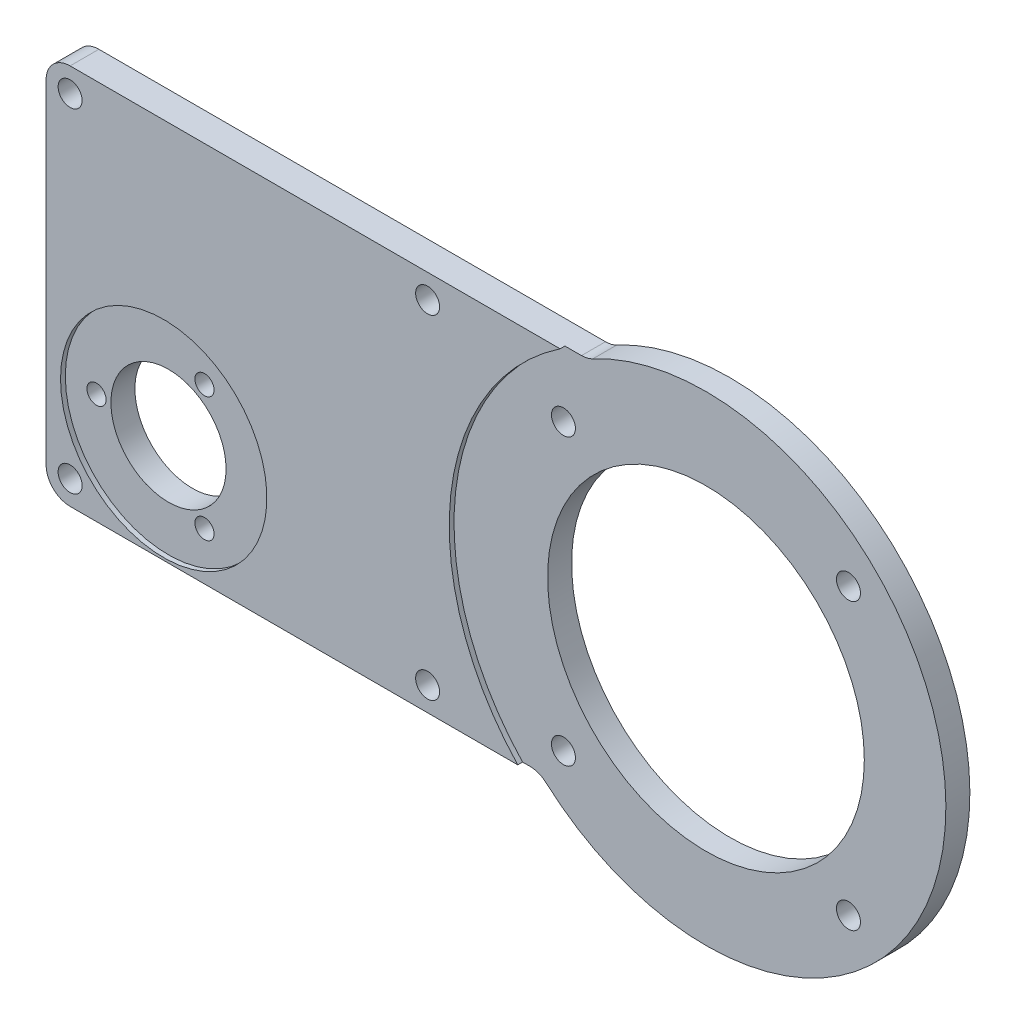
ISO-10303-21;
HEADER;
FILE_DESCRIPTION(('STEP AP214'),'2;1');
FILE_NAME('part.step','',(''),(''),'','','');
FILE_SCHEMA(('AUTOMOTIVE_DESIGN { 1 0 10303 214 1 1 1 1 }'));
ENDSEC;
DATA;
#1=APPLICATION_CONTEXT('core data for automotive mechanical design processes');
#2=APPLICATION_PROTOCOL_DEFINITION('international standard','automotive_design',2000,#1);
#3=PRODUCT_CONTEXT('',#1,'mechanical');
#4=PRODUCT('Part','Part','',(#3));
#5=PRODUCT_RELATED_PRODUCT_CATEGORY('part','',(#4));
#6=PRODUCT_DEFINITION_FORMATION('','',#4);
#7=PRODUCT_DEFINITION_CONTEXT('part definition',#1,'design');
#8=PRODUCT_DEFINITION('design','',#6,#7);
#9=PRODUCT_DEFINITION_SHAPE('','',#8);
#10=(LENGTH_UNIT() NAMED_UNIT(*) SI_UNIT(.MILLI.,.METRE.));
#11=(NAMED_UNIT(*) PLANE_ANGLE_UNIT() SI_UNIT($,.RADIAN.));
#12=(NAMED_UNIT(*) SI_UNIT($,.STERADIAN.) SOLID_ANGLE_UNIT());
#13=UNCERTAINTY_MEASURE_WITH_UNIT(LENGTH_MEASURE(1.E-05),#10,'distance_accuracy_value','');
#14=(GEOMETRIC_REPRESENTATION_CONTEXT(3) GLOBAL_UNCERTAINTY_ASSIGNED_CONTEXT((#13)) GLOBAL_UNIT_ASSIGNED_CONTEXT((#10,
#11,#12)) REPRESENTATION_CONTEXT('',''));
#15=CARTESIAN_POINT('',(0.,0.,0.));
#16=DIRECTION('',(0.,0.,1.));
#17=DIRECTION('',(1.,0.,0.));
#18=AXIS2_PLACEMENT_3D('',#15,#16,#17);
#19=CARTESIAN_POINT('',(-224.,-28.,10.));
#20=DIRECTION('',(0.,0.,-1.));
#21=DIRECTION('',(-1.,0.,0.));
#22=AXIS2_PLACEMENT_3D('',#19,#20,#21);
#23=PLANE('',#22);
#24=CARTESIAN_POINT('',(-209.,-53.9807621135,10.));
#25=DIRECTION('',(0.,0.,1.));
#26=DIRECTION('',(1.,0.,0.));
#27=AXIS2_PLACEMENT_3D('',#24,#25,#26);
#28=CIRCLE('',#27,4.);
#29=CARTESIAN_POINT('',(-205.,-53.9807621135,10.));
#30=VERTEX_POINT('',#29);
#31=EDGE_CURVE('E331',#30,#30,#28,.T.);
#32=ORIENTED_EDGE('',*,*,#31,.F.);
#33=EDGE_LOOP('',(#32));
#34=FACE_BOUND('',#33,.T.);
#35=CARTESIAN_POINT('',(-209.,-2.01923788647,10.));
#36=DIRECTION('',(0.,0.,1.));
#37=DIRECTION('',(1.,0.,0.));
#38=AXIS2_PLACEMENT_3D('',#35,#36,#37);
#39=CIRCLE('',#38,4.);
#40=CARTESIAN_POINT('',(-205.,-2.01923788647,10.));
#41=VERTEX_POINT('',#40);
#42=EDGE_CURVE('E319',#41,#41,#39,.T.);
#43=ORIENTED_EDGE('',*,*,#42,.F.);
#44=EDGE_LOOP('',(#43));
#45=FACE_BOUND('',#44,.T.);
#46=CARTESIAN_POINT('',(-224.,-28.,10.));
#47=DIRECTION('',(0.,0.,1.));
#48=DIRECTION('',(-1.,0.,0.));
#49=AXIS2_PLACEMENT_3D('',#46,#47,#48);
#50=CIRCLE('',#49,43.);
#51=CARTESIAN_POINT('',(-267.,-28.,10.));
#52=VERTEX_POINT('',#51);
#53=EDGE_CURVE('E115',#52,#52,#50,.T.);
#54=ORIENTED_EDGE('',*,*,#53,.T.);
#55=EDGE_LOOP('',(#54));
#56=FACE_BOUND('',#55,.T.);
#57=CARTESIAN_POINT('',(-254.,-28.,10.));
#58=DIRECTION('',(0.,0.,1.));
#59=DIRECTION('',(1.,0.,0.));
#60=AXIS2_PLACEMENT_3D('',#57,#58,#59);
#61=CIRCLE('',#60,4.);
#62=CARTESIAN_POINT('',(-250.,-28.,10.));
#63=VERTEX_POINT('',#62);
#64=EDGE_CURVE('E325',#63,#63,#61,.T.);
#65=ORIENTED_EDGE('',*,*,#64,.F.);
#66=EDGE_LOOP('',(#65));
#67=FACE_BOUND('',#66,.T.);
#68=CARTESIAN_POINT('',(-224.,-28.,10.));
#69=DIRECTION('',(0.,0.,1.));
#70=DIRECTION('',(1.,0.,0.));
#71=AXIS2_PLACEMENT_3D('',#68,#69,#70);
#72=CIRCLE('',#71,24.);
#73=CARTESIAN_POINT('',(-200.,-28.,10.));
#74=VERTEX_POINT('',#73);
#75=EDGE_CURVE('E337',#74,#74,#72,.T.);
#76=ORIENTED_EDGE('',*,*,#75,.F.);
#77=EDGE_LOOP('',(#76));
#78=FACE_BOUND('',#77,.T.);
#79=ADVANCED_FACE('F31',(#34,#45,#56,#67,#78),#23,.F.);
#80=CARTESIAN_POINT('',(-51.8748493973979,96.999999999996,12.));
#81=DIRECTION('',(0.,0.,-1.));
#82=DIRECTION('',(-1.,0.,0.));
#83=AXIS2_PLACEMENT_3D('',#80,#81,#82);
#84=CYLINDRICAL_SURFACE('',#83,10.0000000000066);
#85=DIRECTION('',(0.,0.,-1.));
#86=VECTOR('',#85,1.);
#87=CARTESIAN_POINT('',(-51.8748493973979,86.9999999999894,12.));
#88=LINE('',#87,#86);
#89=CARTESIAN_POINT('',(-51.8748493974,86.9999999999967,10.));
#90=VERTEX_POINT('',#89);
#91=CARTESIAN_POINT('',(-51.8748493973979,86.9999999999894,0.));
#92=VERTEX_POINT('',#91);
#93=EDGE_CURVE('E11',#90,#92,#88,.T.);
#94=ORIENTED_EDGE('',*,*,#93,.F.);
#95=CARTESIAN_POINT('',(-51.8748493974,97.,10.));
#96=DIRECTION('',(0.,0.,-1.));
#97=DIRECTION('',(-1.,0.,0.));
#98=AXIS2_PLACEMENT_3D('',#95,#96,#97);
#99=CIRCLE('',#98,10.0000000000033);
#100=CARTESIAN_POINT('',(-47.1589539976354,88.1818181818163,10.));
#101=VERTEX_POINT('',#100);
#102=EDGE_CURVE('E166',#101,#90,#99,.T.);
#103=ORIENTED_EDGE('',*,*,#102,.F.);
#104=DIRECTION('',(0.,0.,-1.));
#105=VECTOR('',#104,1.);
#106=CARTESIAN_POINT('',(-47.1589539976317,88.1818181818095,12.));
#107=LINE('',#106,#105);
#108=CARTESIAN_POINT('',(-47.1589539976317,88.1818181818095,0.));
#109=VERTEX_POINT('',#108);
#110=EDGE_CURVE('E35',#101,#109,#107,.T.);
#111=ORIENTED_EDGE('',*,*,#110,.T.);
#112=CARTESIAN_POINT('',(-51.8748493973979,96.999999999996,0.));
#113=DIRECTION('',(0.,0.,1.));
#114=DIRECTION('',(1.,0.,0.));
#115=AXIS2_PLACEMENT_3D('',#112,#113,#114);
#116=CIRCLE('',#115,10.0000000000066);
#117=EDGE_CURVE('E124',#92,#109,#116,.T.);
#118=ORIENTED_EDGE('',*,*,#117,.F.);
#119=EDGE_LOOP('',(#94,#103,#111,#118));
#120=FACE_BOUND('',#119,.T.);
#121=ADVANCED_FACE('F33',(#120),#84,.F.);
#122=CARTESIAN_POINT('',(-73.3212111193,-82.,12.));
#123=DIRECTION('',(0.,0.,-1.));
#124=DIRECTION('',(-1.,0.,0.));
#125=AXIS2_PLACEMENT_3D('',#122,#123,#124);
#126=CYLINDRICAL_SURFACE('',#125,10.000000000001);
#127=DIRECTION('',(0.,0.,-1.));
#128=VECTOR('',#127,1.);
#129=CARTESIAN_POINT('',(-66.6556464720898,-74.5454545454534,12.));
#130=LINE('',#129,#128);
#131=CARTESIAN_POINT('',(-66.655646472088,-74.5454545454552,10.));
#132=VERTEX_POINT('',#131);
#133=CARTESIAN_POINT('',(-66.6556464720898,-74.5454545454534,0.));
#134=VERTEX_POINT('',#133);
#135=EDGE_CURVE('E154',#132,#134,#130,.T.);
#136=ORIENTED_EDGE('',*,*,#135,.F.);
#137=CARTESIAN_POINT('',(-73.3212111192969,-82.0000000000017,10.));
#138=DIRECTION('',(0.,0.,-1.));
#139=DIRECTION('',(-1.,0.,0.));
#140=AXIS2_PLACEMENT_3D('',#137,#138,#139);
#141=CIRCLE('',#140,10.0000000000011);
#142=CARTESIAN_POINT('',(-73.3212111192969,-72.0000000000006,10.));
#143=VERTEX_POINT('',#142);
#144=EDGE_CURVE('E203',#143,#132,#141,.T.);
#145=ORIENTED_EDGE('',*,*,#144,.F.);
#146=DIRECTION('',(0.,0.,-1.));
#147=VECTOR('',#146,1.);
#148=CARTESIAN_POINT('',(-73.3212111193,-71.999999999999,12.));
#149=LINE('',#148,#147);
#150=CARTESIAN_POINT('',(-73.3212111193,-71.999999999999,0.));
#151=VERTEX_POINT('',#150);
#152=EDGE_CURVE('E153',#143,#151,#149,.T.);
#153=ORIENTED_EDGE('',*,*,#152,.T.);
#154=CARTESIAN_POINT('',(-73.3212111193,-82.,0.));
#155=DIRECTION('',(0.,0.,1.));
#156=DIRECTION('',(1.,0.,0.));
#157=AXIS2_PLACEMENT_3D('',#154,#155,#156);
#158=CIRCLE('',#157,10.000000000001);
#159=EDGE_CURVE('E172',#134,#151,#158,.T.);
#160=ORIENTED_EDGE('',*,*,#159,.F.);
#161=EDGE_LOOP('',(#136,#145,#153,#160));
#162=FACE_BOUND('',#161,.T.);
#163=ADVANCED_FACE('F207',(#162),#126,.F.);
#164=CARTESIAN_POINT('',(0.,0.,12.));
#165=DIRECTION('',(0.,0.,-1.));
#166=DIRECTION('',(-1.,0.,0.));
#167=AXIS2_PLACEMENT_3D('',#164,#165,#166);
#168=CYLINDRICAL_SURFACE('',#167,100.000000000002);
#169=ORIENTED_EDGE('',*,*,#110,.F.);
#170=CARTESIAN_POINT('',(-2.63331023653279E-12,4.92314522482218E-12,10.));
#171=DIRECTION('',(0.,0.,1.));
#172=DIRECTION('',(1.,0.,0.));
#173=AXIS2_PLACEMENT_3D('',#170,#171,#172);
#174=CIRCLE('',#173,100.000000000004);
#175=EDGE_CURVE('E114',#132,#101,#174,.T.);
#176=ORIENTED_EDGE('',*,*,#175,.F.);
#177=ORIENTED_EDGE('',*,*,#135,.T.);
#178=CARTESIAN_POINT('',(0.,0.,0.));
#179=DIRECTION('',(0.,0.,-1.));
#180=DIRECTION('',(-1.,0.,0.));
#181=AXIS2_PLACEMENT_3D('',#178,#179,#180);
#182=CIRCLE('',#181,100.000000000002);
#183=EDGE_CURVE('E168',#109,#134,#182,.T.);
#184=ORIENTED_EDGE('',*,*,#183,.F.);
#185=EDGE_LOOP('',(#169,#176,#177,#184));
#186=FACE_BOUND('',#185,.T.);
#187=ADVANCED_FACE('F169',(#186),#168,.T.);
#188=CARTESIAN_POINT('',(-262.999999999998,86.9999999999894,12.));
#189=DIRECTION('',(0.,1.,0.));
#190=DIRECTION('',(0.,0.,1.));
#191=AXIS2_PLACEMENT_3D('',#188,#189,#190);
#192=PLANE('',#191);
#193=DIRECTION('',(0.,0.,1.));
#194=VECTOR('',#193,1.);
#195=CARTESIAN_POINT('',(-58.7877538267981,86.9999999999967,10.));
#196=LINE('',#195,#194);
#197=CARTESIAN_POINT('',(-58.7877538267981,86.9999999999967,10.));
#198=VERTEX_POINT('',#197);
#199=CARTESIAN_POINT('',(-58.7877538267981,86.9999999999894,12.));
#200=VERTEX_POINT('',#199);
#201=EDGE_CURVE('E48',#198,#200,#196,.T.);
#202=ORIENTED_EDGE('',*,*,#201,.F.);
#203=DIRECTION('',(-1.,0.,0.));
#204=VECTOR('',#203,1.);
#205=CARTESIAN_POINT('',(-51.8748493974,86.9999999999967,10.));
#206=LINE('',#205,#204);
#207=EDGE_CURVE('E194',#90,#198,#206,.T.);
#208=ORIENTED_EDGE('',*,*,#207,.F.);
#209=ORIENTED_EDGE('',*,*,#93,.T.);
#210=DIRECTION('',(1.,0.,0.));
#211=VECTOR('',#210,1.);
#212=CARTESIAN_POINT('',(-262.999999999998,86.9999999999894,0.));
#213=LINE('',#212,#211);
#214=CARTESIAN_POINT('',(-262.999999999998,86.9999999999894,0.));
#215=VERTEX_POINT('',#214);
#216=EDGE_CURVE('E131',#215,#92,#213,.T.);
#217=ORIENTED_EDGE('',*,*,#216,.F.);
#218=DIRECTION('',(0.,0.,-1.));
#219=VECTOR('',#218,1.);
#220=CARTESIAN_POINT('',(-262.999999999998,86.9999999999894,12.));
#221=LINE('',#220,#219);
#222=CARTESIAN_POINT('',(-262.999999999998,86.9999999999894,12.));
#223=VERTEX_POINT('',#222);
#224=EDGE_CURVE('E40',#223,#215,#221,.T.);
#225=ORIENTED_EDGE('',*,*,#224,.F.);
#226=DIRECTION('',(1.,0.,0.));
#227=VECTOR('',#226,1.);
#228=CARTESIAN_POINT('',(-262.999999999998,86.9999999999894,12.));
#229=LINE('',#228,#227);
#230=EDGE_CURVE('E144',#223,#200,#229,.T.);
#231=ORIENTED_EDGE('',*,*,#230,.T.);
#232=EDGE_LOOP('',(#202,#208,#209,#217,#225,#231));
#233=FACE_BOUND('',#232,.T.);
#234=ADVANCED_FACE('F191',(#233),#192,.T.);
#235=CARTESIAN_POINT('',(-263.,76.9999999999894,12.));
#236=DIRECTION('',(0.,0.,-1.));
#237=DIRECTION('',(-1.,0.,0.));
#238=AXIS2_PLACEMENT_3D('',#235,#236,#237);
#239=CYLINDRICAL_SURFACE('',#238,10.);
#240=CARTESIAN_POINT('',(-263.,76.9999999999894,0.));
#241=DIRECTION('',(0.,0.,-1.));
#242=DIRECTION('',(-1.,0.,0.));
#243=AXIS2_PLACEMENT_3D('',#240,#241,#242);
#244=CIRCLE('',#243,10.);
#245=CARTESIAN_POINT('',(-273.,76.9999999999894,0.));
#246=VERTEX_POINT('',#245);
#247=EDGE_CURVE('E136',#246,#215,#244,.T.);
#248=ORIENTED_EDGE('',*,*,#247,.F.);
#249=DIRECTION('',(0.,0.,-1.));
#250=VECTOR('',#249,1.);
#251=CARTESIAN_POINT('',(-273.,76.9999999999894,12.));
#252=LINE('',#251,#250);
#253=CARTESIAN_POINT('',(-273.,76.9999999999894,12.));
#254=VERTEX_POINT('',#253);
#255=EDGE_CURVE('E147',#254,#246,#252,.T.);
#256=ORIENTED_EDGE('',*,*,#255,.F.);
#257=CARTESIAN_POINT('',(-263.,76.9999999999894,12.));
#258=DIRECTION('',(0.,0.,-1.));
#259=DIRECTION('',(-1.,0.,0.));
#260=AXIS2_PLACEMENT_3D('',#257,#258,#259);
#261=CIRCLE('',#260,10.);
#262=EDGE_CURVE('E142',#254,#223,#261,.T.);
#263=ORIENTED_EDGE('',*,*,#262,.T.);
#264=ORIENTED_EDGE('',*,*,#224,.T.);
#265=EDGE_LOOP('',(#248,#256,#263,#264));
#266=FACE_BOUND('',#265,.T.);
#267=ADVANCED_FACE('F215',(#266),#239,.T.);
#268=CARTESIAN_POINT('',(-273.,-62.,12.));
#269=DIRECTION('',(-1.,0.,0.));
#270=DIRECTION('',(0.,0.,1.));
#271=AXIS2_PLACEMENT_3D('',#268,#269,#270);
#272=PLANE('',#271);
#273=DIRECTION('',(0.,1.,0.));
#274=VECTOR('',#273,1.);
#275=CARTESIAN_POINT('',(-273.,-62.,0.));
#276=LINE('',#275,#274);
#277=CARTESIAN_POINT('',(-273.,-62.,0.));
#278=VERTEX_POINT('',#277);
#279=EDGE_CURVE('E186',#278,#246,#276,.T.);
#280=ORIENTED_EDGE('',*,*,#279,.F.);
#281=DIRECTION('',(0.,0.,-1.));
#282=VECTOR('',#281,1.);
#283=CARTESIAN_POINT('',(-273.,-62.,12.));
#284=LINE('',#283,#282);
#285=CARTESIAN_POINT('',(-273.,-62.,12.));
#286=VERTEX_POINT('',#285);
#287=EDGE_CURVE('E149',#286,#278,#284,.T.);
#288=ORIENTED_EDGE('',*,*,#287,.F.);
#289=DIRECTION('',(0.,1.,0.));
#290=VECTOR('',#289,1.);
#291=CARTESIAN_POINT('',(-273.,-62.,12.));
#292=LINE('',#291,#290);
#293=EDGE_CURVE('E133',#286,#254,#292,.T.);
#294=ORIENTED_EDGE('',*,*,#293,.T.);
#295=ORIENTED_EDGE('',*,*,#255,.T.);
#296=EDGE_LOOP('',(#280,#288,#294,#295));
#297=FACE_BOUND('',#296,.T.);
#298=ADVANCED_FACE('F213',(#297),#272,.T.);
#299=CARTESIAN_POINT('',(-263.,-62.,12.));
#300=DIRECTION('',(0.,0.,-1.));
#301=DIRECTION('',(-1.,0.,0.));
#302=AXIS2_PLACEMENT_3D('',#299,#300,#301);
#303=CYLINDRICAL_SURFACE('',#302,10.);
#304=CARTESIAN_POINT('',(-263.,-62.,0.));
#305=DIRECTION('',(0.,0.,-1.));
#306=DIRECTION('',(-1.,0.,0.));
#307=AXIS2_PLACEMENT_3D('',#304,#305,#306);
#308=CIRCLE('',#307,10.);
#309=CARTESIAN_POINT('',(-263.,-72.,0.));
#310=VERTEX_POINT('',#309);
#311=EDGE_CURVE('E183',#310,#278,#308,.T.);
#312=ORIENTED_EDGE('',*,*,#311,.F.);
#313=DIRECTION('',(0.,0.,-1.));
#314=VECTOR('',#313,1.);
#315=CARTESIAN_POINT('',(-263.,-72.,12.));
#316=LINE('',#315,#314);
#317=CARTESIAN_POINT('',(-263.,-72.,12.));
#318=VERTEX_POINT('',#317);
#319=EDGE_CURVE('E151',#318,#310,#316,.T.);
#320=ORIENTED_EDGE('',*,*,#319,.F.);
#321=CARTESIAN_POINT('',(-263.,-62.,12.));
#322=DIRECTION('',(0.,0.,-1.));
#323=DIRECTION('',(-1.,0.,0.));
#324=AXIS2_PLACEMENT_3D('',#321,#322,#323);
#325=CIRCLE('',#324,10.);
#326=EDGE_CURVE('E130',#318,#286,#325,.T.);
#327=ORIENTED_EDGE('',*,*,#326,.T.);
#328=ORIENTED_EDGE('',*,*,#287,.T.);
#329=EDGE_LOOP('',(#312,#320,#327,#328));
#330=FACE_BOUND('',#329,.T.);
#331=ADVANCED_FACE('F211',(#330),#303,.T.);
#332=CARTESIAN_POINT('',(-73.3212111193,-72.,12.));
#333=DIRECTION('',(0.,-1.,0.));
#334=DIRECTION('',(0.,0.,-1.));
#335=AXIS2_PLACEMENT_3D('',#332,#333,#334);
#336=PLANE('',#335);
#337=DIRECTION('',(0.,0.,1.));
#338=VECTOR('',#337,1.);
#339=CARTESIAN_POINT('',(-76.4264352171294,-72.0000000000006,10.));
#340=LINE('',#339,#338);
#341=CARTESIAN_POINT('',(-76.4264352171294,-72.0000000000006,10.));
#342=VERTEX_POINT('',#341);
#343=CARTESIAN_POINT('',(-76.4264352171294,-72.0000000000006,12.));
#344=VERTEX_POINT('',#343);
#345=EDGE_CURVE('E109',#342,#344,#340,.T.);
#346=ORIENTED_EDGE('',*,*,#345,.T.);
#347=DIRECTION('',(-1.,0.,0.));
#348=VECTOR('',#347,1.);
#349=CARTESIAN_POINT('',(-73.3212111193,-72.,12.));
#350=LINE('',#349,#348);
#351=EDGE_CURVE('E120',#344,#318,#350,.T.);
#352=ORIENTED_EDGE('',*,*,#351,.T.);
#353=ORIENTED_EDGE('',*,*,#319,.T.);
#354=DIRECTION('',(-1.,0.,0.));
#355=VECTOR('',#354,1.);
#356=CARTESIAN_POINT('',(-73.3212111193,-72.,0.));
#357=LINE('',#356,#355);
#358=EDGE_CURVE('E180',#151,#310,#357,.T.);
#359=ORIENTED_EDGE('',*,*,#358,.F.);
#360=ORIENTED_EDGE('',*,*,#152,.F.);
#361=DIRECTION('',(1.,0.,0.));
#362=VECTOR('',#361,1.);
#363=CARTESIAN_POINT('',(-76.4264352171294,-72.0000000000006,10.));
#364=LINE('',#363,#362);
#365=EDGE_CURVE('E123',#342,#143,#364,.T.);
#366=ORIENTED_EDGE('',*,*,#365,.F.);
#367=EDGE_LOOP('',(#346,#352,#353,#359,#360,#366));
#368=FACE_BOUND('',#367,.T.);
#369=ADVANCED_FACE('F119',(#368),#336,.T.);
#370=CARTESIAN_POINT('',(-51.8748493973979,96.999999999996,12.));
#371=DIRECTION('',(0.,0.,1.));
#372=DIRECTION('',(1.,0.,0.));
#373=AXIS2_PLACEMENT_3D('',#370,#371,#372);
#374=PLANE('',#373);
#375=CARTESIAN_POINT('',(-263.,77.,12.));
#376=DIRECTION('',(0.,0.,1.));
#377=DIRECTION('',(1.,0.,0.));
#378=AXIS2_PLACEMENT_3D('',#375,#376,#377);
#379=CIRCLE('',#378,5.);
#380=CARTESIAN_POINT('',(-258.,77.,12.));
#381=VERTEX_POINT('',#380);
#382=EDGE_CURVE('E257',#381,#381,#379,.T.);
#383=ORIENTED_EDGE('',*,*,#382,.F.);
#384=EDGE_LOOP('',(#383));
#385=FACE_BOUND('',#384,.T.);
#386=CARTESIAN_POINT('',(-263.,-62.,12.));
#387=DIRECTION('',(0.,0.,1.));
#388=DIRECTION('',(1.,0.,0.));
#389=AXIS2_PLACEMENT_3D('',#386,#387,#388);
#390=CIRCLE('',#389,5.);
#391=CARTESIAN_POINT('',(-258.,-62.,12.));
#392=VERTEX_POINT('',#391);
#393=EDGE_CURVE('E261',#392,#392,#390,.T.);
#394=ORIENTED_EDGE('',*,*,#393,.F.);
#395=EDGE_LOOP('',(#394));
#396=FACE_BOUND('',#395,.T.);
#397=CARTESIAN_POINT('',(-114.,-62.,12.));
#398=DIRECTION('',(0.,0.,1.));
#399=DIRECTION('',(1.,0.,0.));
#400=AXIS2_PLACEMENT_3D('',#397,#398,#399);
#401=CIRCLE('',#400,4.99999999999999);
#402=CARTESIAN_POINT('',(-109.,-62.,12.));
#403=VERTEX_POINT('',#402);
#404=EDGE_CURVE('E265',#403,#403,#401,.T.);
#405=ORIENTED_EDGE('',*,*,#404,.F.);
#406=EDGE_LOOP('',(#405));
#407=FACE_BOUND('',#406,.T.);
#408=CARTESIAN_POINT('',(-114.,77.,12.));
#409=DIRECTION('',(0.,0.,1.));
#410=DIRECTION('',(1.,0.,0.));
#411=AXIS2_PLACEMENT_3D('',#408,#409,#410);
#412=CIRCLE('',#411,4.99999999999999);
#413=CARTESIAN_POINT('',(-109.,77.,12.));
#414=VERTEX_POINT('',#413);
#415=EDGE_CURVE('E269',#414,#414,#412,.T.);
#416=ORIENTED_EDGE('',*,*,#415,.F.);
#417=EDGE_LOOP('',(#416));
#418=FACE_BOUND('',#417,.T.);
#419=CARTESIAN_POINT('',(-224.,-28.,12.));
#420=DIRECTION('',(0.,0.,1.));
#421=DIRECTION('',(-1.,0.,0.));
#422=AXIS2_PLACEMENT_3D('',#419,#420,#421);
#423=CIRCLE('',#422,43.);
#424=CARTESIAN_POINT('',(-267.,-28.,12.));
#425=VERTEX_POINT('',#424);
#426=EDGE_CURVE('E272',#425,#425,#423,.T.);
#427=ORIENTED_EDGE('',*,*,#426,.F.);
#428=EDGE_LOOP('',(#427));
#429=FACE_BOUND('',#428,.T.);
#430=CARTESIAN_POINT('',(-2.63331023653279E-12,4.92314522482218E-12,12.));
#431=DIRECTION('',(0.,0.,1.));
#432=DIRECTION('',(1.,0.,0.));
#433=AXIS2_PLACEMENT_3D('',#430,#431,#432);
#434=CIRCLE('',#433,104.999999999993);
#435=EDGE_CURVE('E106',#200,#344,#434,.T.);
#436=ORIENTED_EDGE('',*,*,#435,.F.);
#437=ORIENTED_EDGE('',*,*,#230,.F.);
#438=ORIENTED_EDGE('',*,*,#262,.F.);
#439=ORIENTED_EDGE('',*,*,#293,.F.);
#440=ORIENTED_EDGE('',*,*,#326,.F.);
#441=ORIENTED_EDGE('',*,*,#351,.F.);
#442=EDGE_LOOP('',(#436,#437,#438,#439,#440,#441));
#443=FACE_BOUND('',#442,.T.);
#444=ADVANCED_FACE('F127',(#385,#396,#407,#418,#429,#443),#374,.T.);
#445=CARTESIAN_POINT('',(-51.8748493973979,96.999999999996,0.));
#446=DIRECTION('',(0.,0.,1.));
#447=DIRECTION('',(1.,0.,0.));
#448=AXIS2_PLACEMENT_3D('',#445,#446,#447);
#449=PLANE('',#448);
#450=CARTESIAN_POINT('',(-263.,77.,0.));
#451=DIRECTION('',(0.,0.,1.));
#452=DIRECTION('',(1.,0.,0.));
#453=AXIS2_PLACEMENT_3D('',#450,#451,#452);
#454=CIRCLE('',#453,5.);
#455=CARTESIAN_POINT('',(-258.,77.,0.));
#456=VERTEX_POINT('',#455);
#457=EDGE_CURVE('E344',#456,#456,#454,.T.);
#458=ORIENTED_EDGE('',*,*,#457,.T.);
#459=EDGE_LOOP('',(#458));
#460=FACE_BOUND('',#459,.T.);
#461=CARTESIAN_POINT('',(-263.,-62.,0.));
#462=DIRECTION('',(0.,0.,1.));
#463=DIRECTION('',(1.,0.,0.));
#464=AXIS2_PLACEMENT_3D('',#461,#462,#463);
#465=CIRCLE('',#464,5.);
#466=CARTESIAN_POINT('',(-258.,-62.,0.));
#467=VERTEX_POINT('',#466);
#468=EDGE_CURVE('E340',#467,#467,#465,.T.);
#469=ORIENTED_EDGE('',*,*,#468,.T.);
#470=EDGE_LOOP('',(#469));
#471=FACE_BOUND('',#470,.T.);
#472=CARTESIAN_POINT('',(-224.,-28.,0.));
#473=DIRECTION('',(0.,0.,1.));
#474=DIRECTION('',(1.,0.,0.));
#475=AXIS2_PLACEMENT_3D('',#472,#473,#474);
#476=CIRCLE('',#475,24.);
#477=CARTESIAN_POINT('',(-200.,-28.,0.));
#478=VERTEX_POINT('',#477);
#479=EDGE_CURVE('E334',#478,#478,#476,.T.);
#480=ORIENTED_EDGE('',*,*,#479,.T.);
#481=EDGE_LOOP('',(#480));
#482=FACE_BOUND('',#481,.T.);
#483=CARTESIAN_POINT('',(-209.,-53.9807621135,0.));
#484=DIRECTION('',(0.,0.,1.));
#485=DIRECTION('',(1.,0.,0.));
#486=AXIS2_PLACEMENT_3D('',#483,#484,#485);
#487=CIRCLE('',#486,4.);
#488=CARTESIAN_POINT('',(-205.,-53.9807621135,0.));
#489=VERTEX_POINT('',#488);
#490=EDGE_CURVE('E328',#489,#489,#487,.T.);
#491=ORIENTED_EDGE('',*,*,#490,.T.);
#492=EDGE_LOOP('',(#491));
#493=FACE_BOUND('',#492,.T.);
#494=CARTESIAN_POINT('',(-254.,-28.,0.));
#495=DIRECTION('',(0.,0.,1.));
#496=DIRECTION('',(1.,0.,0.));
#497=AXIS2_PLACEMENT_3D('',#494,#495,#496);
#498=CIRCLE('',#497,4.);
#499=CARTESIAN_POINT('',(-250.,-28.,0.));
#500=VERTEX_POINT('',#499);
#501=EDGE_CURVE('E322',#500,#500,#498,.T.);
#502=ORIENTED_EDGE('',*,*,#501,.T.);
#503=EDGE_LOOP('',(#502));
#504=FACE_BOUND('',#503,.T.);
#505=CARTESIAN_POINT('',(-209.,-2.01923788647,0.));
#506=DIRECTION('',(0.,0.,1.));
#507=DIRECTION('',(1.,0.,0.));
#508=AXIS2_PLACEMENT_3D('',#505,#506,#507);
#509=CIRCLE('',#508,4.);
#510=CARTESIAN_POINT('',(-205.,-2.01923788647,0.));
#511=VERTEX_POINT('',#510);
#512=EDGE_CURVE('E316',#511,#511,#509,.T.);
#513=ORIENTED_EDGE('',*,*,#512,.T.);
#514=EDGE_LOOP('',(#513));
#515=FACE_BOUND('',#514,.T.);
#516=CARTESIAN_POINT('',(-114.,-62.,0.));
#517=DIRECTION('',(0.,0.,1.));
#518=DIRECTION('',(1.,0.,0.));
#519=AXIS2_PLACEMENT_3D('',#516,#517,#518);
#520=CIRCLE('',#519,5.);
#521=CARTESIAN_POINT('',(-109.,-62.,0.));
#522=VERTEX_POINT('',#521);
#523=EDGE_CURVE('E312',#522,#522,#520,.T.);
#524=ORIENTED_EDGE('',*,*,#523,.T.);
#525=EDGE_LOOP('',(#524));
#526=FACE_BOUND('',#525,.T.);
#527=CARTESIAN_POINT('',(-59.3969696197,-59.3969696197,0.));
#528=DIRECTION('',(0.,0.,1.));
#529=DIRECTION('',(1.,0.,0.));
#530=AXIS2_PLACEMENT_3D('',#527,#528,#529);
#531=CIRCLE('',#530,4.99999999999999);
#532=CARTESIAN_POINT('',(-54.3969696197,-59.3969696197,0.));
#533=VERTEX_POINT('',#532);
#534=EDGE_CURVE('E306',#533,#533,#531,.T.);
#535=ORIENTED_EDGE('',*,*,#534,.T.);
#536=EDGE_LOOP('',(#535));
#537=FACE_BOUND('',#536,.T.);
#538=CARTESIAN_POINT('',(0.,0.,0.));
#539=DIRECTION('',(0.,0.,1.));
#540=DIRECTION('',(1.,0.,0.));
#541=AXIS2_PLACEMENT_3D('',#538,#539,#540);
#542=CIRCLE('',#541,66.);
#543=CARTESIAN_POINT('',(66.,0.,0.));
#544=VERTEX_POINT('',#543);
#545=EDGE_CURVE('E300',#544,#544,#542,.T.);
#546=ORIENTED_EDGE('',*,*,#545,.T.);
#547=EDGE_LOOP('',(#546));
#548=FACE_BOUND('',#547,.T.);
#549=CARTESIAN_POINT('',(-59.3969696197,59.3969696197,0.));
#550=DIRECTION('',(0.,0.,1.));
#551=DIRECTION('',(1.,0.,0.));
#552=AXIS2_PLACEMENT_3D('',#549,#550,#551);
#553=CIRCLE('',#552,4.99999999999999);
#554=CARTESIAN_POINT('',(-54.3969696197,59.3969696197,0.));
#555=VERTEX_POINT('',#554);
#556=EDGE_CURVE('E294',#555,#555,#553,.T.);
#557=ORIENTED_EDGE('',*,*,#556,.T.);
#558=EDGE_LOOP('',(#557));
#559=FACE_BOUND('',#558,.T.);
#560=CARTESIAN_POINT('',(-114.,77.,0.));
#561=DIRECTION('',(0.,0.,1.));
#562=DIRECTION('',(1.,0.,0.));
#563=AXIS2_PLACEMENT_3D('',#560,#561,#562);
#564=CIRCLE('',#563,5.);
#565=CARTESIAN_POINT('',(-109.,77.,0.));
#566=VERTEX_POINT('',#565);
#567=EDGE_CURVE('E290',#566,#566,#564,.T.);
#568=ORIENTED_EDGE('',*,*,#567,.T.);
#569=EDGE_LOOP('',(#568));
#570=FACE_BOUND('',#569,.T.);
#571=CARTESIAN_POINT('',(59.3969696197,59.3969696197,0.));
#572=DIRECTION('',(0.,0.,1.));
#573=DIRECTION('',(1.,0.,0.));
#574=AXIS2_PLACEMENT_3D('',#571,#572,#573);
#575=CIRCLE('',#574,4.99999999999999);
#576=CARTESIAN_POINT('',(64.3969696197,59.3969696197,0.));
#577=VERTEX_POINT('',#576);
#578=EDGE_CURVE('E284',#577,#577,#575,.T.);
#579=ORIENTED_EDGE('',*,*,#578,.T.);
#580=EDGE_LOOP('',(#579));
#581=FACE_BOUND('',#580,.T.);
#582=CARTESIAN_POINT('',(59.3969696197,-59.3969696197,0.));
#583=DIRECTION('',(0.,0.,1.));
#584=DIRECTION('',(1.,0.,0.));
#585=AXIS2_PLACEMENT_3D('',#582,#583,#584);
#586=CIRCLE('',#585,4.99999999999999);
#587=CARTESIAN_POINT('',(64.3969696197,-59.3969696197,0.));
#588=VERTEX_POINT('',#587);
#589=EDGE_CURVE('E274',#588,#588,#586,.T.);
#590=ORIENTED_EDGE('',*,*,#589,.T.);
#591=EDGE_LOOP('',(#590));
#592=FACE_BOUND('',#591,.T.);
#593=ORIENTED_EDGE('',*,*,#117,.T.);
#594=ORIENTED_EDGE('',*,*,#183,.T.);
#595=ORIENTED_EDGE('',*,*,#159,.T.);
#596=ORIENTED_EDGE('',*,*,#358,.T.);
#597=ORIENTED_EDGE('',*,*,#311,.T.);
#598=ORIENTED_EDGE('',*,*,#279,.T.);
#599=ORIENTED_EDGE('',*,*,#247,.T.);
#600=ORIENTED_EDGE('',*,*,#216,.T.);
#601=EDGE_LOOP('',(#593,#594,#595,#596,#597,#598,#599,#600));
#602=FACE_BOUND('',#601,.T.);
#603=ADVANCED_FACE('F174',(#460,#471,#482,#493,#504,#515,#526,#537,#548,#559,#570,#581,#592,
#602),#449,.F.);
#604=CARTESIAN_POINT('',(-2.63331023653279E-12,4.92314522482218E-12,10.));
#605=DIRECTION('',(0.,0.,1.));
#606=DIRECTION('',(1.,0.,0.));
#607=AXIS2_PLACEMENT_3D('',#604,#605,#606);
#608=CYLINDRICAL_SURFACE('',#607,104.999999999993);
#609=ORIENTED_EDGE('',*,*,#435,.T.);
#610=ORIENTED_EDGE('',*,*,#345,.F.);
#611=CARTESIAN_POINT('',(-2.63331023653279E-12,4.92314522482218E-12,10.));
#612=DIRECTION('',(0.,0.,1.));
#613=DIRECTION('',(1.,0.,0.));
#614=AXIS2_PLACEMENT_3D('',#611,#612,#613);
#615=CIRCLE('',#614,104.999999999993);
#616=EDGE_CURVE('E196',#198,#342,#615,.T.);
#617=ORIENTED_EDGE('',*,*,#616,.F.);
#618=ORIENTED_EDGE('',*,*,#201,.T.);
#619=EDGE_LOOP('',(#609,#610,#617,#618));
#620=FACE_BOUND('',#619,.T.);
#621=ADVANCED_FACE('F108',(#620),#608,.F.);
#622=CARTESIAN_POINT('',(-2.63331023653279E-12,4.92314522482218E-12,10.));
#623=DIRECTION('',(0.,0.,1.));
#624=DIRECTION('',(1.,0.,0.));
#625=AXIS2_PLACEMENT_3D('',#622,#623,#624);
#626=PLANE('',#625);
#627=CARTESIAN_POINT('',(-59.3969696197,-59.3969696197,10.));
#628=DIRECTION('',(0.,0.,1.));
#629=DIRECTION('',(1.,0.,0.));
#630=AXIS2_PLACEMENT_3D('',#627,#628,#629);
#631=CIRCLE('',#630,4.99999999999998);
#632=CARTESIAN_POINT('',(-54.3969696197,-59.3969696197,10.));
#633=VERTEX_POINT('',#632);
#634=EDGE_CURVE('E309',#633,#633,#631,.T.);
#635=ORIENTED_EDGE('',*,*,#634,.F.);
#636=EDGE_LOOP('',(#635));
#637=FACE_BOUND('',#636,.T.);
#638=CARTESIAN_POINT('',(0.,0.,9.99999999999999));
#639=DIRECTION('',(0.,0.,1.));
#640=DIRECTION('',(1.,0.,0.));
#641=AXIS2_PLACEMENT_3D('',#638,#639,#640);
#642=CIRCLE('',#641,66.);
#643=CARTESIAN_POINT('',(66.,0.,9.99999999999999));
#644=VERTEX_POINT('',#643);
#645=EDGE_CURVE('E303',#644,#644,#642,.T.);
#646=ORIENTED_EDGE('',*,*,#645,.F.);
#647=EDGE_LOOP('',(#646));
#648=FACE_BOUND('',#647,.T.);
#649=CARTESIAN_POINT('',(-59.3969696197,59.3969696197,10.));
#650=DIRECTION('',(0.,0.,1.));
#651=DIRECTION('',(1.,0.,0.));
#652=AXIS2_PLACEMENT_3D('',#649,#650,#651);
#653=CIRCLE('',#652,4.99999999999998);
#654=CARTESIAN_POINT('',(-54.3969696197,59.3969696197,10.));
#655=VERTEX_POINT('',#654);
#656=EDGE_CURVE('E297',#655,#655,#653,.T.);
#657=ORIENTED_EDGE('',*,*,#656,.F.);
#658=EDGE_LOOP('',(#657));
#659=FACE_BOUND('',#658,.T.);
#660=CARTESIAN_POINT('',(59.3969696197,59.3969696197,10.));
#661=DIRECTION('',(0.,0.,1.));
#662=DIRECTION('',(1.,0.,0.));
#663=AXIS2_PLACEMENT_3D('',#660,#661,#662);
#664=CIRCLE('',#663,4.99999999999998);
#665=CARTESIAN_POINT('',(64.3969696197,59.3969696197,10.));
#666=VERTEX_POINT('',#665);
#667=EDGE_CURVE('E287',#666,#666,#664,.T.);
#668=ORIENTED_EDGE('',*,*,#667,.F.);
#669=EDGE_LOOP('',(#668));
#670=FACE_BOUND('',#669,.T.);
#671=CARTESIAN_POINT('',(59.3969696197,-59.3969696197,10.));
#672=DIRECTION('',(0.,0.,1.));
#673=DIRECTION('',(1.,0.,0.));
#674=AXIS2_PLACEMENT_3D('',#671,#672,#673);
#675=CIRCLE('',#674,4.99999999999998);
#676=CARTESIAN_POINT('',(64.3969696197,-59.3969696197,10.));
#677=VERTEX_POINT('',#676);
#678=EDGE_CURVE('E279',#677,#677,#675,.T.);
#679=ORIENTED_EDGE('',*,*,#678,.F.);
#680=EDGE_LOOP('',(#679));
#681=FACE_BOUND('',#680,.T.);
#682=ORIENTED_EDGE('',*,*,#175,.T.);
#683=ORIENTED_EDGE('',*,*,#102,.T.);
#684=ORIENTED_EDGE('',*,*,#207,.T.);
#685=ORIENTED_EDGE('',*,*,#616,.T.);
#686=ORIENTED_EDGE('',*,*,#365,.T.);
#687=ORIENTED_EDGE('',*,*,#144,.T.);
#688=EDGE_LOOP('',(#682,#683,#684,#685,#686,#687));
#689=FACE_BOUND('',#688,.T.);
#690=ADVANCED_FACE('F205',(#637,#648,#659,#670,#681,#689),#626,.T.);
#691=CARTESIAN_POINT('',(-224.,-28.,10.));
#692=DIRECTION('',(0.,0.,1.));
#693=DIRECTION('',(1.,0.,0.));
#694=AXIS2_PLACEMENT_3D('',#691,#692,#693);
#695=CYLINDRICAL_SURFACE('',#694,43.);
#696=ORIENTED_EDGE('',*,*,#53,.F.);
#697=EDGE_LOOP('',(#696));
#698=FACE_BOUND('',#697,.T.);
#699=ORIENTED_EDGE('',*,*,#426,.T.);
#700=EDGE_LOOP('',(#699));
#701=FACE_BOUND('',#700,.T.);
#702=ADVANCED_FACE('F236',(#698,#701),#695,.F.);
#703=CARTESIAN_POINT('',(59.3969696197,-59.3969696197,10.));
#704=DIRECTION('',(0.,0.,1.));
#705=DIRECTION('',(1.,0.,0.));
#706=AXIS2_PLACEMENT_3D('',#703,#704,#705);
#707=CYLINDRICAL_SURFACE('',#706,4.99999999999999);
#708=ORIENTED_EDGE('',*,*,#589,.F.);
#709=EDGE_LOOP('',(#708));
#710=FACE_BOUND('',#709,.T.);
#711=ORIENTED_EDGE('',*,*,#678,.T.);
#712=EDGE_LOOP('',(#711));
#713=FACE_BOUND('',#712,.T.);
#714=ADVANCED_FACE('F234',(#710,#713),#707,.F.);
#715=CARTESIAN_POINT('',(59.3969696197,59.3969696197,10.));
#716=DIRECTION('',(0.,0.,1.));
#717=DIRECTION('',(1.,0.,0.));
#718=AXIS2_PLACEMENT_3D('',#715,#716,#717);
#719=CYLINDRICAL_SURFACE('',#718,4.99999999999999);
#720=ORIENTED_EDGE('',*,*,#578,.F.);
#721=EDGE_LOOP('',(#720));
#722=FACE_BOUND('',#721,.T.);
#723=ORIENTED_EDGE('',*,*,#667,.T.);
#724=EDGE_LOOP('',(#723));
#725=FACE_BOUND('',#724,.T.);
#726=ADVANCED_FACE('F394',(#722,#725),#719,.F.);
#727=CARTESIAN_POINT('',(-114.,77.,12.));
#728=DIRECTION('',(0.,0.,1.));
#729=DIRECTION('',(1.,0.,0.));
#730=AXIS2_PLACEMENT_3D('',#727,#728,#729);
#731=CYLINDRICAL_SURFACE('',#730,5.);
#732=ORIENTED_EDGE('',*,*,#567,.F.);
#733=EDGE_LOOP('',(#732));
#734=FACE_BOUND('',#733,.T.);
#735=ORIENTED_EDGE('',*,*,#415,.T.);
#736=EDGE_LOOP('',(#735));
#737=FACE_BOUND('',#736,.T.);
#738=ADVANCED_FACE('F391',(#734,#737),#731,.F.);
#739=CARTESIAN_POINT('',(-59.3969696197,59.3969696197,10.));
#740=DIRECTION('',(0.,0.,1.));
#741=DIRECTION('',(1.,0.,0.));
#742=AXIS2_PLACEMENT_3D('',#739,#740,#741);
#743=CYLINDRICAL_SURFACE('',#742,4.99999999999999);
#744=ORIENTED_EDGE('',*,*,#556,.F.);
#745=EDGE_LOOP('',(#744));
#746=FACE_BOUND('',#745,.T.);
#747=ORIENTED_EDGE('',*,*,#656,.T.);
#748=EDGE_LOOP('',(#747));
#749=FACE_BOUND('',#748,.T.);
#750=ADVANCED_FACE('F387',(#746,#749),#743,.F.);
#751=CARTESIAN_POINT('',(0.,0.,10.));
#752=DIRECTION('',(0.,0.,1.));
#753=DIRECTION('',(1.,0.,0.));
#754=AXIS2_PLACEMENT_3D('',#751,#752,#753);
#755=CYLINDRICAL_SURFACE('',#754,66.);
#756=ORIENTED_EDGE('',*,*,#545,.F.);
#757=EDGE_LOOP('',(#756));
#758=FACE_BOUND('',#757,.T.);
#759=ORIENTED_EDGE('',*,*,#645,.T.);
#760=EDGE_LOOP('',(#759));
#761=FACE_BOUND('',#760,.T.);
#762=ADVANCED_FACE('F383',(#758,#761),#755,.F.);
#763=CARTESIAN_POINT('',(-59.3969696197,-59.3969696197,10.));
#764=DIRECTION('',(0.,0.,1.));
#765=DIRECTION('',(1.,0.,0.));
#766=AXIS2_PLACEMENT_3D('',#763,#764,#765);
#767=CYLINDRICAL_SURFACE('',#766,4.99999999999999);
#768=ORIENTED_EDGE('',*,*,#534,.F.);
#769=EDGE_LOOP('',(#768));
#770=FACE_BOUND('',#769,.T.);
#771=ORIENTED_EDGE('',*,*,#634,.T.);
#772=EDGE_LOOP('',(#771));
#773=FACE_BOUND('',#772,.T.);
#774=ADVANCED_FACE('F379',(#770,#773),#767,.F.);
#775=CARTESIAN_POINT('',(-114.,-62.,12.));
#776=DIRECTION('',(0.,0.,1.));
#777=DIRECTION('',(1.,0.,0.));
#778=AXIS2_PLACEMENT_3D('',#775,#776,#777);
#779=CYLINDRICAL_SURFACE('',#778,5.);
#780=ORIENTED_EDGE('',*,*,#523,.F.);
#781=EDGE_LOOP('',(#780));
#782=FACE_BOUND('',#781,.T.);
#783=ORIENTED_EDGE('',*,*,#404,.T.);
#784=EDGE_LOOP('',(#783));
#785=FACE_BOUND('',#784,.T.);
#786=ADVANCED_FACE('F375',(#782,#785),#779,.F.);
#787=CARTESIAN_POINT('',(-209.,-2.01923788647,10.));
#788=DIRECTION('',(0.,0.,1.));
#789=DIRECTION('',(1.,0.,0.));
#790=AXIS2_PLACEMENT_3D('',#787,#788,#789);
#791=CYLINDRICAL_SURFACE('',#790,4.);
#792=ORIENTED_EDGE('',*,*,#512,.F.);
#793=EDGE_LOOP('',(#792));
#794=FACE_BOUND('',#793,.T.);
#795=ORIENTED_EDGE('',*,*,#42,.T.);
#796=EDGE_LOOP('',(#795));
#797=FACE_BOUND('',#796,.T.);
#798=ADVANCED_FACE('F371',(#794,#797),#791,.F.);
#799=CARTESIAN_POINT('',(-254.,-28.,10.));
#800=DIRECTION('',(0.,0.,1.));
#801=DIRECTION('',(1.,0.,0.));
#802=AXIS2_PLACEMENT_3D('',#799,#800,#801);
#803=CYLINDRICAL_SURFACE('',#802,4.);
#804=ORIENTED_EDGE('',*,*,#501,.F.);
#805=EDGE_LOOP('',(#804));
#806=FACE_BOUND('',#805,.T.);
#807=ORIENTED_EDGE('',*,*,#64,.T.);
#808=EDGE_LOOP('',(#807));
#809=FACE_BOUND('',#808,.T.);
#810=ADVANCED_FACE('F367',(#806,#809),#803,.F.);
#811=CARTESIAN_POINT('',(-209.,-53.9807621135,10.));
#812=DIRECTION('',(0.,0.,1.));
#813=DIRECTION('',(1.,0.,0.));
#814=AXIS2_PLACEMENT_3D('',#811,#812,#813);
#815=CYLINDRICAL_SURFACE('',#814,4.);
#816=ORIENTED_EDGE('',*,*,#490,.F.);
#817=EDGE_LOOP('',(#816));
#818=FACE_BOUND('',#817,.T.);
#819=ORIENTED_EDGE('',*,*,#31,.T.);
#820=EDGE_LOOP('',(#819));
#821=FACE_BOUND('',#820,.T.);
#822=ADVANCED_FACE('F363',(#818,#821),#815,.F.);
#823=CARTESIAN_POINT('',(-224.,-28.,10.));
#824=DIRECTION('',(0.,0.,1.));
#825=DIRECTION('',(1.,0.,0.));
#826=AXIS2_PLACEMENT_3D('',#823,#824,#825);
#827=CYLINDRICAL_SURFACE('',#826,24.);
#828=ORIENTED_EDGE('',*,*,#479,.F.);
#829=EDGE_LOOP('',(#828));
#830=FACE_BOUND('',#829,.T.);
#831=ORIENTED_EDGE('',*,*,#75,.T.);
#832=EDGE_LOOP('',(#831));
#833=FACE_BOUND('',#832,.T.);
#834=ADVANCED_FACE('F356',(#830,#833),#827,.F.);
#835=CARTESIAN_POINT('',(-263.,-62.,12.));
#836=DIRECTION('',(0.,0.,1.));
#837=DIRECTION('',(1.,0.,0.));
#838=AXIS2_PLACEMENT_3D('',#835,#836,#837);
#839=CYLINDRICAL_SURFACE('',#838,5.);
#840=ORIENTED_EDGE('',*,*,#468,.F.);
#841=EDGE_LOOP('',(#840));
#842=FACE_BOUND('',#841,.T.);
#843=ORIENTED_EDGE('',*,*,#393,.T.);
#844=EDGE_LOOP('',(#843));
#845=FACE_BOUND('',#844,.T.);
#846=ADVANCED_FACE('F350',(#842,#845),#839,.F.);
#847=CARTESIAN_POINT('',(-263.,77.,12.));
#848=DIRECTION('',(0.,0.,1.));
#849=DIRECTION('',(1.,0.,0.));
#850=AXIS2_PLACEMENT_3D('',#847,#848,#849);
#851=CYLINDRICAL_SURFACE('',#850,5.);
#852=ORIENTED_EDGE('',*,*,#457,.F.);
#853=EDGE_LOOP('',(#852));
#854=FACE_BOUND('',#853,.T.);
#855=ORIENTED_EDGE('',*,*,#382,.T.);
#856=EDGE_LOOP('',(#855));
#857=FACE_BOUND('',#856,.T.);
#858=ADVANCED_FACE('F348',(#854,#857),#851,.F.);
#859=CLOSED_SHELL('',(#79,#121,#163,#187,#234,#267,#298,#331,#369,#444,#603,#621,#690,#702,#714,
#726,#738,#750,#762,#774,#786,#798,#810,#822,#834,#846,#858));
#860=MANIFOLD_SOLID_BREP('B2',#859);
#861=ADVANCED_BREP_SHAPE_REPRESENTATION('',(#18,#860),#14);
#862=SHAPE_DEFINITION_REPRESENTATION(#9,#861);
ENDSEC;
END-ISO-10303-21;
